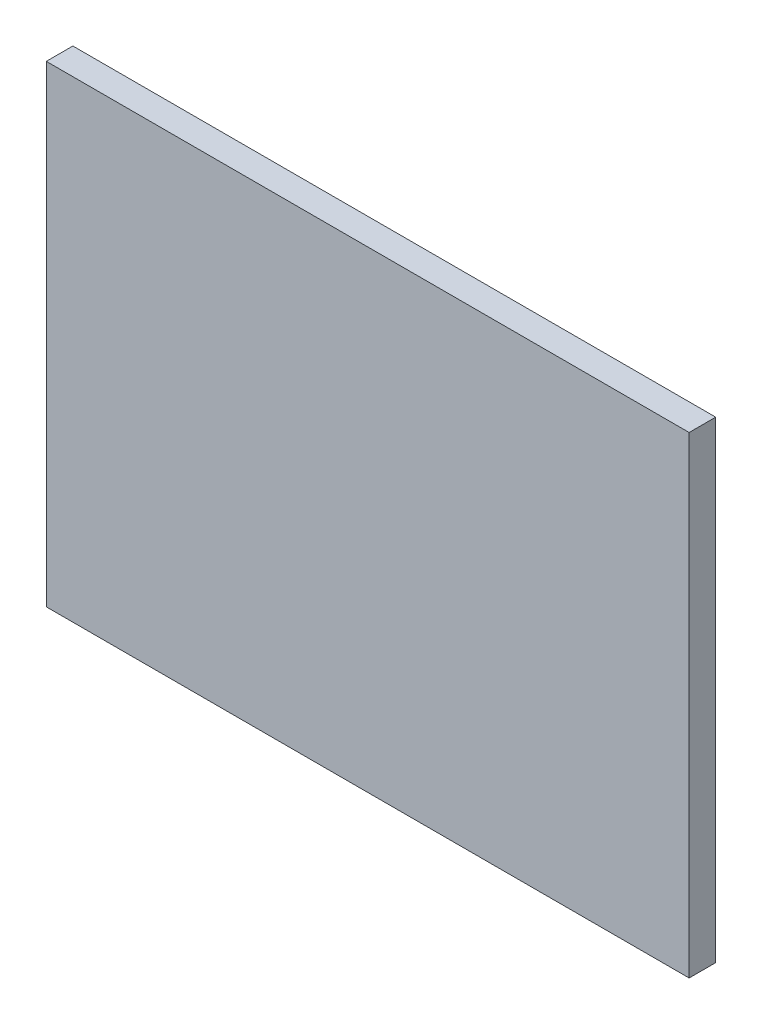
from build123d import *

# Parameters (mm, degrees)
SKETCH1_W      = 38.1
SKETCH1_H      = 28
EXTRUDE1_DEPTH = 1.5748


with BuildPart() as part:
    # Sketch1 → Extrude1 (new body)
    with BuildSketch(Plane.XY):
        with Locations((-24.037339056, 5.1972103)):
            Rectangle(SKETCH1_W, SKETCH1_H)
    extrude(amount=EXTRUDE1_DEPTH)


solid = part.part
